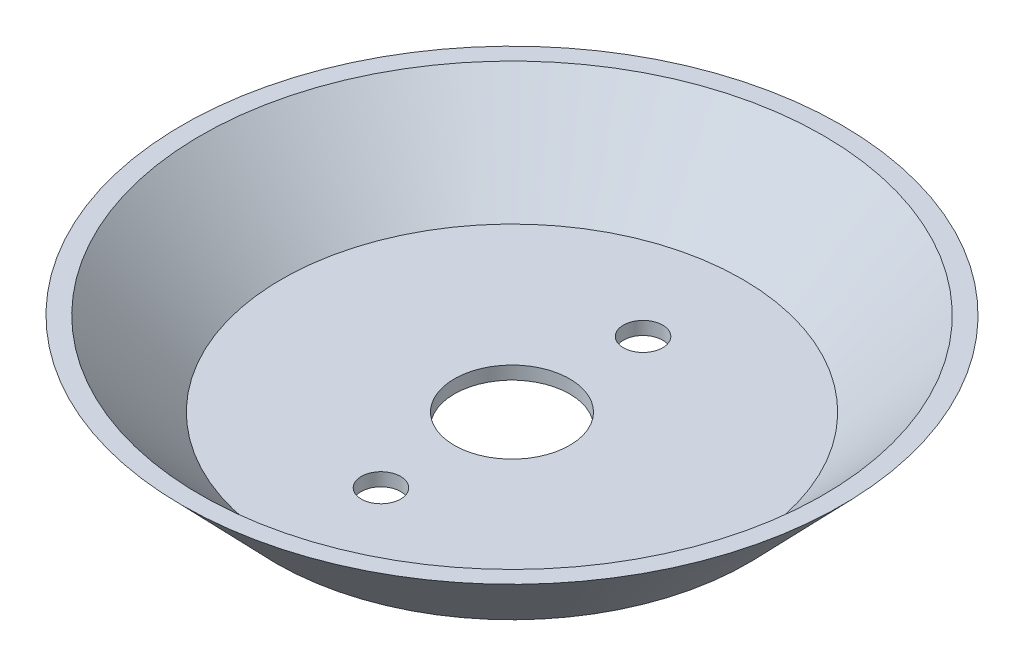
from build123d import *

# Parameters (mm, degrees)
COQUE4_T                = -1
ESQUISSE4_R             = 4.4
ENL_V_MAT_EXTRU_2_DEPTH = 7.14
ESQUISSE5_R             = 1.5
ENL_V_MAT_EXTRU_3_DEPTH = 10


with BuildPart() as part:
    # Esquisse3 → R_volution1 (revolve)
    with BuildSketch(Plane.XY, mode=Mode.PRIVATE) as r_volution1_sk:
        Polygon((18, 0), (25.15, 7.4), (0, 7.4), (0, 0), align=None)
    revolve(r_volution1_sk.sketch.rotate(Axis((0, 38.86372549, 0), (0, -1, 0)), 90), axis=Axis((0, 38.86372549, 0), (0, -1, 0)))

    # Coque4
    coque4_openings = [part.faces().sort_by_distance(p)[0] for p in [
        (0, 7.4, 0),
    ]]
    offset(amount=COQUE4_T, openings=coque4_openings, kind=Kind.INTERSECTION)

    # Esquisse4 → Enl_v. mat.-Extru.2 (cut)
    with BuildSketch(Plane(origin=(0, 1, 0), x_dir=(-1, 0, 0), z_dir=(0, 1, 0))):
        with Locations(Location((0, 0, 0), (0, 0, 90))):
            Circle(ESQUISSE4_R)
    extrude(amount=-ENL_V_MAT_EXTRU_2_DEPTH, mode=Mode.SUBTRACT)

    # Esquisse5 → Enl_v. mat.-Extru.3 (cut)
    with BuildSketch(Plane(origin=(0, 1, 0), x_dir=(-1, 0, 0), z_dir=(0, 1, 0))):
        with Locations(Location((0, -10, 0), (0, 0, 90))):
            Circle(ESQUISSE5_R)
        with Locations(Location((0, 10, 0), (0, 0, 270))):
            Circle(ESQUISSE5_R)
    extrude(amount=-ENL_V_MAT_EXTRU_3_DEPTH, mode=Mode.SUBTRACT)


solid = part.part
